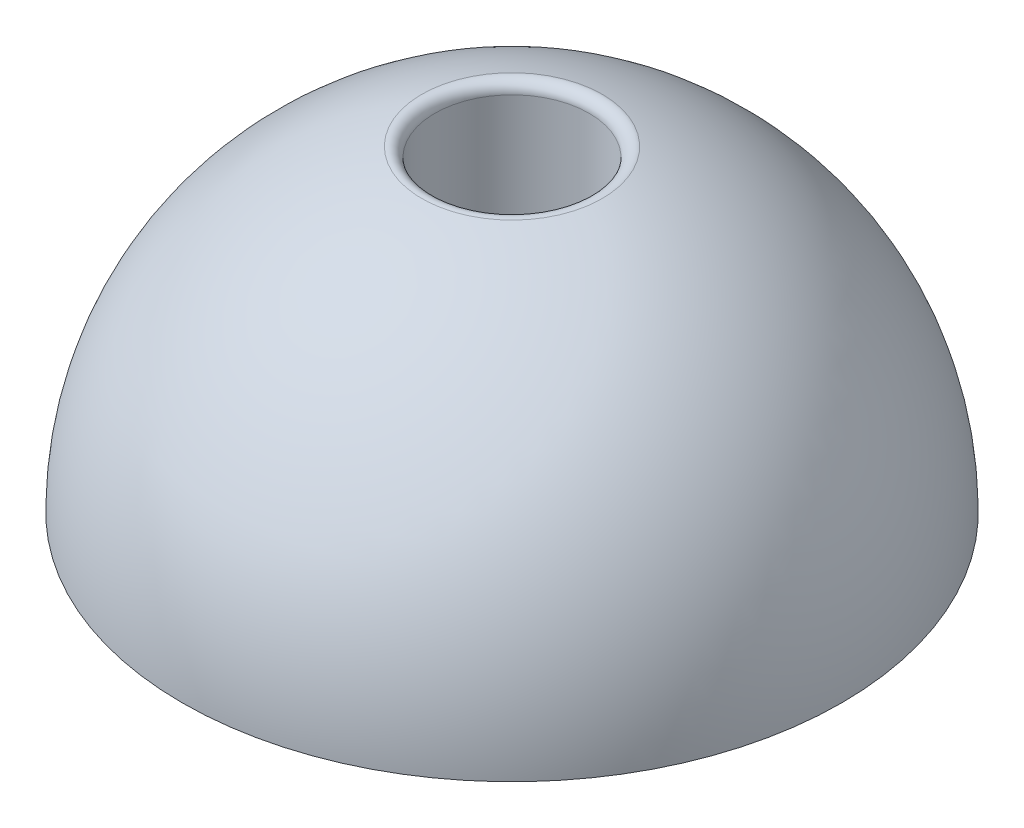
from build123d import *

# Parameters (mm, degrees)
SKETCH3_R          = 9.525
CUT_EXTRUDE1_DEPTH = 71.479123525
FILLET1_R          = 1.27


with BuildPart() as part:
    # Sketch1 → Revolve1 (revolve)
    with BuildSketch(Plane.XY):
        with BuildLine():
            Line((0, 0), (40.69114094, 0))
            ThreePointArc((40.69114094, 0), (28.772981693, 28.772981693), (0, 40.69114094))
            Line((0, 40.69114094), (0, 0))
        make_face()
    revolve(axis=Axis((0, 0, 0), (0, -1, 0)))

    # Sketch3 → Cut-Extrude1 (cut, through all)
    with BuildSketch(Plane.XZ):
        with Locations(Location((0, 0, 0), (0, 0, 270))):
            Circle(SKETCH3_R)
    extrude(amount=-CUT_EXTRUDE1_DEPTH, mode=Mode.SUBTRACT)

    # Fillet1
    fillet1_edges = [part.edges().sort_by_distance(p)[0] for p in [
        (-6.735192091, 39.560628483, 6.735192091),
    ]]
    fillet(fillet1_edges, radius=FILLET1_R)


solid = part.part
